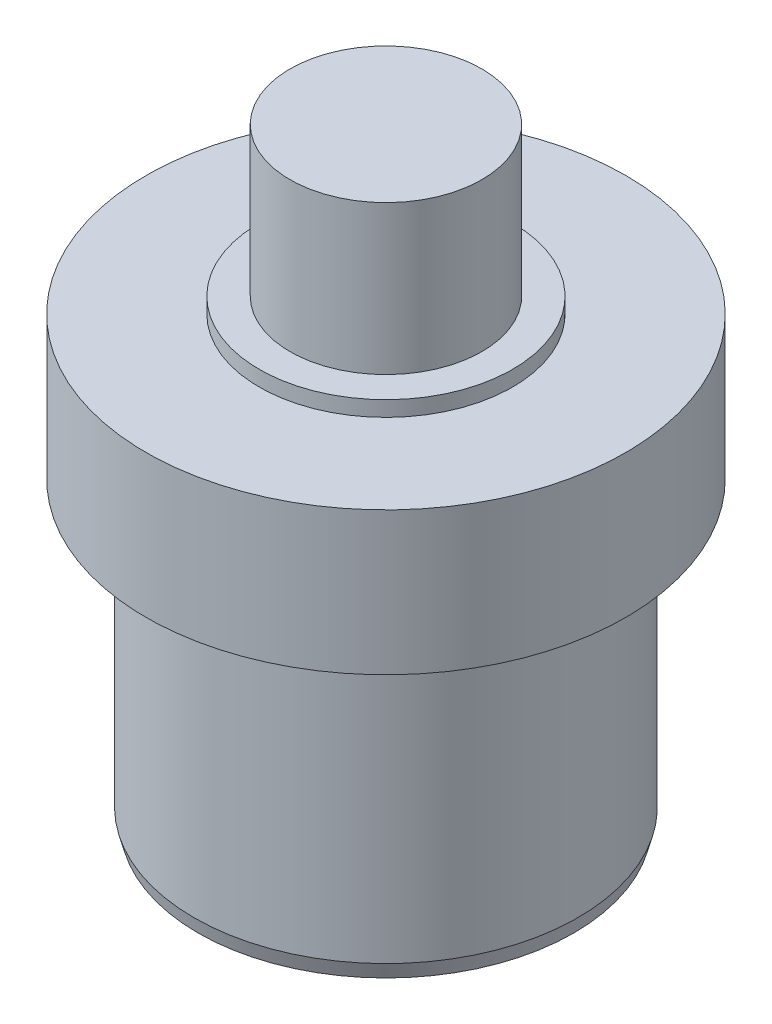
ISO-10303-21;
HEADER;
FILE_DESCRIPTION(('STEP AP214'),'2;1');
FILE_NAME('part.step','',(''),(''),'','','');
FILE_SCHEMA(('AUTOMOTIVE_DESIGN { 1 0 10303 214 1 1 1 1 }'));
ENDSEC;
DATA;
#1=APPLICATION_CONTEXT('core data for automotive mechanical design processes');
#2=APPLICATION_PROTOCOL_DEFINITION('international standard','automotive_design',2000,#1);
#3=PRODUCT_CONTEXT('',#1,'mechanical');
#4=PRODUCT('Part','Part','',(#3));
#5=PRODUCT_RELATED_PRODUCT_CATEGORY('part','',(#4));
#6=PRODUCT_DEFINITION_FORMATION('','',#4);
#7=PRODUCT_DEFINITION_CONTEXT('part definition',#1,'design');
#8=PRODUCT_DEFINITION('design','',#6,#7);
#9=PRODUCT_DEFINITION_SHAPE('','',#8);
#10=(LENGTH_UNIT() NAMED_UNIT(*) SI_UNIT(.MILLI.,.METRE.));
#11=(NAMED_UNIT(*) PLANE_ANGLE_UNIT() SI_UNIT($,.RADIAN.));
#12=(NAMED_UNIT(*) SI_UNIT($,.STERADIAN.) SOLID_ANGLE_UNIT());
#13=UNCERTAINTY_MEASURE_WITH_UNIT(LENGTH_MEASURE(1.E-05),#10,'distance_accuracy_value','');
#14=(GEOMETRIC_REPRESENTATION_CONTEXT(3) GLOBAL_UNCERTAINTY_ASSIGNED_CONTEXT((#13)) GLOBAL_UNIT_ASSIGNED_CONTEXT((#10,
#11,#12)) REPRESENTATION_CONTEXT('',''));
#15=CARTESIAN_POINT('',(0.,0.,0.));
#16=DIRECTION('',(0.,0.,1.));
#17=DIRECTION('',(1.,0.,0.));
#18=AXIS2_PLACEMENT_3D('',#15,#16,#17);
#19=CARTESIAN_POINT('',(0.,2.61620000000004,0.));
#20=DIRECTION('',(0.,0.999999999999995,0.));
#21=DIRECTION('',(0.,0.,0.999999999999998));
#22=AXIS2_PLACEMENT_3D('',#19,#20,#21);
#23=PLANE('',#22);
#24=CARTESIAN_POINT('',(0.,2.61620000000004,0.));
#25=DIRECTION('',(0.,0.999999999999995,0.));
#26=DIRECTION('',(0.,0.,0.999999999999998));
#27=AXIS2_PLACEMENT_3D('',#24,#25,#26);
#28=CIRCLE('',#27,2.0955);
#29=CARTESIAN_POINT('',(0.,2.61620000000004,-2.09549999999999));
#30=VERTEX_POINT('',#29);
#31=EDGE_CURVE('E55',#30,#30,#28,.T.);
#32=ORIENTED_EDGE('',*,*,#31,.T.);
#33=EDGE_LOOP('',(#32));
#34=FACE_BOUND('',#33,.T.);
#35=CARTESIAN_POINT('',(0.,2.61620000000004,0.));
#36=DIRECTION('',(0.,0.999999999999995,0.));
#37=DIRECTION('',(0.,0.,0.999999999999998));
#38=AXIS2_PLACEMENT_3D('',#35,#36,#37);
#39=CIRCLE('',#38,1.5875);
#40=CARTESIAN_POINT('',(0.,2.61620000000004,-1.58749999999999));
#41=VERTEX_POINT('',#40);
#42=EDGE_CURVE('E64',#41,#41,#39,.T.);
#43=ORIENTED_EDGE('',*,*,#42,.F.);
#44=EDGE_LOOP('',(#43));
#45=FACE_BOUND('',#44,.T.);
#46=ADVANCED_FACE('F32',(#34,#45),#23,.T.);
#47=CARTESIAN_POINT('',(0.,2.36220000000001,0.));
#48=DIRECTION('',(0.,0.999999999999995,0.));
#49=DIRECTION('',(0.,0.,0.999999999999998));
#50=AXIS2_PLACEMENT_3D('',#47,#48,#49);
#51=PLANE('',#50);
#52=CARTESIAN_POINT('',(0.,2.36220000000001,0.));
#53=DIRECTION('',(0.,0.999999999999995,0.));
#54=DIRECTION('',(0.,0.,0.999999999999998));
#55=AXIS2_PLACEMENT_3D('',#52,#53,#54);
#56=CIRCLE('',#55,3.96875);
#57=CARTESIAN_POINT('',(0.,2.36220000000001,-3.96875000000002));
#58=VERTEX_POINT('',#57);
#59=EDGE_CURVE('E47',#58,#58,#56,.T.);
#60=ORIENTED_EDGE('',*,*,#59,.T.);
#61=EDGE_LOOP('',(#60));
#62=FACE_BOUND('',#61,.T.);
#63=CARTESIAN_POINT('',(0.,2.36220000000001,0.));
#64=DIRECTION('',(0.,0.999999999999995,0.));
#65=DIRECTION('',(0.,0.,0.999999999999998));
#66=AXIS2_PLACEMENT_3D('',#63,#64,#65);
#67=CIRCLE('',#66,2.0955);
#68=CARTESIAN_POINT('',(0.,2.36220000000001,-2.09549999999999));
#69=VERTEX_POINT('',#68);
#70=EDGE_CURVE('E58',#69,#69,#67,.T.);
#71=ORIENTED_EDGE('',*,*,#70,.F.);
#72=EDGE_LOOP('',(#71));
#73=FACE_BOUND('',#72,.T.);
#74=ADVANCED_FACE('F71',(#62,#73),#51,.T.);
#75=CARTESIAN_POINT('',(0.,0.,0.));
#76=DIRECTION('',(0.,0.999999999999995,0.));
#77=DIRECTION('',(0.,0.,0.999999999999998));
#78=AXIS2_PLACEMENT_3D('',#75,#76,#77);
#79=PLANE('',#78);
#80=CARTESIAN_POINT('',(0.,0.,0.));
#81=DIRECTION('',(0.,0.999999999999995,0.));
#82=DIRECTION('',(0.,0.,0.999999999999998));
#83=AXIS2_PLACEMENT_3D('',#80,#81,#82);
#84=CIRCLE('',#83,3.96875);
#85=CARTESIAN_POINT('',(0.,0.,-3.96875000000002));
#86=VERTEX_POINT('',#85);
#87=EDGE_CURVE('E52',#86,#86,#84,.T.);
#88=ORIENTED_EDGE('',*,*,#87,.F.);
#89=EDGE_LOOP('',(#88));
#90=FACE_BOUND('',#89,.T.);
#91=CARTESIAN_POINT('',(0.,0.,0.));
#92=DIRECTION('',(0.,0.999999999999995,0.));
#93=DIRECTION('',(0.,0.,0.999999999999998));
#94=AXIS2_PLACEMENT_3D('',#91,#92,#93);
#95=CIRCLE('',#94,3.175);
#96=CARTESIAN_POINT('',(0.,0.,3.17499999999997));
#97=VERTEX_POINT('',#96);
#98=EDGE_CURVE('E43',#97,#97,#95,.F.);
#99=ORIENTED_EDGE('',*,*,#98,.F.);
#100=EDGE_LOOP('',(#99));
#101=FACE_BOUND('',#100,.T.);
#102=ADVANCED_FACE('F77',(#90,#101),#79,.F.);
#103=CARTESIAN_POINT('',(0.,2.36220000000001,0.));
#104=DIRECTION('',(0.,-0.999999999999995,0.));
#105=DIRECTION('',(0.,0.,-0.999999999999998));
#106=AXIS2_PLACEMENT_3D('',#103,#104,#105);
#107=CYLINDRICAL_SURFACE('',#106,3.96875);
#108=CARTESIAN_POINT('',(0.,2.36220000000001,-3.96875000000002));
#109=CARTESIAN_POINT('',(0.,2.33759375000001,-3.96875000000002));
#110=CARTESIAN_POINT('',(0.,2.31298750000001,-3.96875000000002));
#111=CARTESIAN_POINT('',(0.,2.26377500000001,-3.96875000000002));
#112=CARTESIAN_POINT('',(0.,2.23916875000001,-3.96875000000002));
#113=CARTESIAN_POINT('',(0.,2.18995625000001,-3.96875000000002));
#114=CARTESIAN_POINT('',(0.,2.16535000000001,-3.96875000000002));
#115=CARTESIAN_POINT('',(0.,2.11613750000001,-3.96875000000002));
#116=CARTESIAN_POINT('',(0.,2.09153125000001,-3.96875000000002));
#117=CARTESIAN_POINT('',(0.,2.04231875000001,-3.96875000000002));
#118=CARTESIAN_POINT('',(0.,2.01771250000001,-3.96875000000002));
#119=CARTESIAN_POINT('',(0.,1.96850000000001,-3.96875000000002));
#120=CARTESIAN_POINT('',(0.,1.94389375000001,-3.96875000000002));
#121=CARTESIAN_POINT('',(0.,1.89468125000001,-3.96875000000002));
#122=CARTESIAN_POINT('',(0.,1.87007500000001,-3.96875000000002));
#123=CARTESIAN_POINT('',(0.,1.82086250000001,-3.96875000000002));
#124=CARTESIAN_POINT('',(0.,1.79625625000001,-3.96875000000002));
#125=CARTESIAN_POINT('',(0.,1.74704375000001,-3.96875000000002));
#126=CARTESIAN_POINT('',(0.,1.72243750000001,-3.96875000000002));
#127=CARTESIAN_POINT('',(0.,1.67322500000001,-3.96875000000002));
#128=CARTESIAN_POINT('',(0.,1.64861875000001,-3.96875000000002));
#129=CARTESIAN_POINT('',(0.,1.59940625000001,-3.96875000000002));
#130=CARTESIAN_POINT('',(0.,1.57480000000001,-3.96875000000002));
#131=CARTESIAN_POINT('',(0.,1.52558750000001,-3.96875000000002));
#132=CARTESIAN_POINT('',(0.,1.50098125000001,-3.96875000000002));
#133=CARTESIAN_POINT('',(0.,1.45176875,-3.96875000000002));
#134=CARTESIAN_POINT('',(0.,1.4271625,-3.96875000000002));
#135=CARTESIAN_POINT('',(0.,1.37795,-3.96875000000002));
#136=CARTESIAN_POINT('',(0.,1.35334375,-3.96875000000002));
#137=CARTESIAN_POINT('',(0.,1.30413125,-3.96875000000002));
#138=CARTESIAN_POINT('',(0.,1.279525,-3.96875000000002));
#139=CARTESIAN_POINT('',(0.,1.2303125,-3.96875000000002));
#140=CARTESIAN_POINT('',(0.,1.20570625,-3.96875000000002));
#141=CARTESIAN_POINT('',(0.,1.15649375,-3.96875000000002));
#142=CARTESIAN_POINT('',(0.,1.1318875,-3.96875000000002));
#143=CARTESIAN_POINT('',(0.,1.082675,-3.96875000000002));
#144=CARTESIAN_POINT('',(0.,1.05806875,-3.96875000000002));
#145=CARTESIAN_POINT('',(0.,1.00885625,-3.96875000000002));
#146=CARTESIAN_POINT('',(0.,0.984250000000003,-3.96875000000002));
#147=CARTESIAN_POINT('',(0.,0.935037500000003,-3.96875000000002));
#148=CARTESIAN_POINT('',(0.,0.910431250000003,-3.96875000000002));
#149=CARTESIAN_POINT('',(0.,0.861218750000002,-3.96875000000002));
#150=CARTESIAN_POINT('',(0.,0.836612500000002,-3.96875000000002));
#151=CARTESIAN_POINT('',(0.,0.787400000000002,-3.96875000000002));
#152=CARTESIAN_POINT('',(0.,0.762793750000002,-3.96875000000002));
#153=CARTESIAN_POINT('',(0.,0.713581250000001,-3.96875000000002));
#154=CARTESIAN_POINT('',(0.,0.688975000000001,-3.96875000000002));
#155=CARTESIAN_POINT('',(0.,0.639762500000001,-3.96875000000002));
#156=CARTESIAN_POINT('',(0.,0.615156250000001,-3.96875000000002));
#157=CARTESIAN_POINT('',(0.,0.565943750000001,-3.96875000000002));
#158=CARTESIAN_POINT('',(0.,0.541337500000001,-3.96875000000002));
#159=CARTESIAN_POINT('',(0.,0.492125,-3.96875000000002));
#160=CARTESIAN_POINT('',(0.,0.46751875,-3.96875000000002));
#161=CARTESIAN_POINT('',(0.,0.41830625,-3.96875000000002));
#162=CARTESIAN_POINT('',(0.,0.3937,-3.96875000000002));
#163=CARTESIAN_POINT('',(0.,0.3444875,-3.96875000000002));
#164=CARTESIAN_POINT('',(0.,0.31988125,-3.96875000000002));
#165=CARTESIAN_POINT('',(0.,0.27066875,-3.96875000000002));
#166=CARTESIAN_POINT('',(0.,0.2460625,-3.96875000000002));
#167=CARTESIAN_POINT('',(0.,0.196849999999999,-3.96875000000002));
#168=CARTESIAN_POINT('',(0.,0.172243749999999,-3.96875000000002));
#169=CARTESIAN_POINT('',(0.,0.123031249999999,-3.96875000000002));
#170=CARTESIAN_POINT('',(0.,0.0984249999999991,-3.96875000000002));
#171=CARTESIAN_POINT('',(0.,0.0492124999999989,-3.96875000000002));
#172=CARTESIAN_POINT('',(0.,0.0246062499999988,-3.96875000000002));
#173=CARTESIAN_POINT('',(0.,0.,-3.96875000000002));
#174=B_SPLINE_CURVE_WITH_KNOTS('',3,(#108,#109,#110,#111,#112,#113,#114,#115,#116,#117,#118,
#119,#120,#121,#122,#123,#124,#125,#126,#127,#128,#129,#130,#131,#132,#133,#134,#135,#136,#137,
#138,#139,#140,#141,#142,#143,#144,#145,#146,#147,#148,#149,#150,#151,#152,#153,#154,#155,#156,
#157,#158,#159,#160,#161,#162,#163,#164,#165,#166,#167,#168,#169,#170,#171,#172,#173),
.UNSPECIFIED.,.F.,.F.,(4,2,2,2,2,2,2,2,2,2,2,2,2,2,2,2,2,2,2,2,2,2,2,2,2,2,2,2,2,2,2,2,4),(0.,
0.0738187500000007,0.147637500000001,0.221456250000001,0.295275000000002,0.369093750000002,
0.442912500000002,0.516731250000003,0.590550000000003,0.664368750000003,0.738187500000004,
0.812006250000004,0.885825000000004,0.959643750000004,1.0334625,1.10728125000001,
1.18110000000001,1.25491875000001,1.32873750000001,1.40255625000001,1.47637500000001,
1.55019375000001,1.62401250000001,1.69783125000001,1.77165000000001,1.84546875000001,
1.91928750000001,1.99310625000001,2.06692500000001,2.14074375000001,2.21456250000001,
2.28838125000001,2.36220000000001),.UNSPECIFIED.);
#175=EDGE_CURVE('BSEAM34',#58,#86,#174,.T.);
#176=ORIENTED_EDGE('',*,*,#59,.F.);
#177=ORIENTED_EDGE('',*,*,#87,.T.);
#178=ORIENTED_EDGE('',*,*,#175,.T.);
#179=ORIENTED_EDGE('',*,*,#175,.F.);
#180=EDGE_LOOP('',(#176,#178,#177,#179));
#181=FACE_BOUND('',#180,.T.);
#182=ADVANCED_FACE('F34',(#181),#107,.T.);
#183=CARTESIAN_POINT('',(0.,-4.95299999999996,0.));
#184=DIRECTION('',(0.,0.999999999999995,0.));
#185=DIRECTION('',(0.,0.,0.999999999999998));
#186=AXIS2_PLACEMENT_3D('',#183,#184,#185);
#187=CYLINDRICAL_SURFACE('',#186,3.175);
#188=CARTESIAN_POINT('',(-1.11022302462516E-13,-4.69899999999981,0.));
#189=DIRECTION('',(0.,-0.999999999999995,0.));
#190=DIRECTION('',(0.,0.,-0.999999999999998));
#191=AXIS2_PLACEMENT_3D('',#188,#189,#190);
#192=CIRCLE('',#191,3.175);
#193=CARTESIAN_POINT('',(0.,-4.69899999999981,3.17499999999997));
#194=VERTEX_POINT('',#193);
#195=EDGE_CURVE('E10',#194,#194,#192,.F.);
#196=CARTESIAN_POINT('',(0.,-4.69899999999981,3.17499999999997));
#197=CARTESIAN_POINT('',(0.,-4.65005208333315,3.17499999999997));
#198=CARTESIAN_POINT('',(0.,-4.60110416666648,3.17499999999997));
#199=CARTESIAN_POINT('',(0.,-4.50320833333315,3.17499999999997));
#200=CARTESIAN_POINT('',(0.,-4.45426041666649,3.17499999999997));
#201=CARTESIAN_POINT('',(0.,-4.35636458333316,3.17499999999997));
#202=CARTESIAN_POINT('',(0.,-4.3074166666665,3.17499999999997));
#203=CARTESIAN_POINT('',(0.,-4.20952083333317,3.17499999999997));
#204=CARTESIAN_POINT('',(0.,-4.1605729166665,3.17499999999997));
#205=CARTESIAN_POINT('',(0.,-4.06267708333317,3.17499999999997));
#206=CARTESIAN_POINT('',(0.,-4.01372916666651,3.17499999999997));
#207=CARTESIAN_POINT('',(0.,-3.91583333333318,3.17499999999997));
#208=CARTESIAN_POINT('',(0.,-3.86688541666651,3.17499999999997));
#209=CARTESIAN_POINT('',(0.,-3.76898958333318,3.17499999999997));
#210=CARTESIAN_POINT('',(0.,-3.72004166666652,3.17499999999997));
#211=CARTESIAN_POINT('',(0.,-3.62214583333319,3.17499999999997));
#212=CARTESIAN_POINT('',(0.,-3.57319791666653,3.17499999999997));
#213=CARTESIAN_POINT('',(0.,-3.4753020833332,3.17499999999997));
#214=CARTESIAN_POINT('',(0.,-3.42635416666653,3.17499999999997));
#215=CARTESIAN_POINT('',(0.,-3.3284583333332,3.17499999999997));
#216=CARTESIAN_POINT('',(0.,-3.27951041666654,3.17499999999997));
#217=CARTESIAN_POINT('',(0.,-3.18161458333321,3.17499999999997));
#218=CARTESIAN_POINT('',(0.,-3.13266666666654,3.17499999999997));
#219=CARTESIAN_POINT('',(0.,-3.03477083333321,3.17499999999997));
#220=CARTESIAN_POINT('',(0.,-2.98582291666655,3.17499999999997));
#221=CARTESIAN_POINT('',(0.,-2.88792708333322,3.17499999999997));
#222=CARTESIAN_POINT('',(0.,-2.83897916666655,3.17499999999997));
#223=CARTESIAN_POINT('',(0.,-2.74108333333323,3.17499999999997));
#224=CARTESIAN_POINT('',(0.,-2.69213541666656,3.17499999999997));
#225=CARTESIAN_POINT('',(0.,-2.59423958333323,3.17499999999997));
#226=CARTESIAN_POINT('',(0.,-2.54529166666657,3.17499999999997));
#227=CARTESIAN_POINT('',(0.,-2.44739583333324,3.17499999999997));
#228=CARTESIAN_POINT('',(0.,-2.39844791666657,3.17499999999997));
#229=CARTESIAN_POINT('',(0.,-2.30055208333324,3.17499999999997));
#230=CARTESIAN_POINT('',(0.,-2.25160416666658,3.17499999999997));
#231=CARTESIAN_POINT('',(0.,-2.15370833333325,3.17499999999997));
#232=CARTESIAN_POINT('',(0.,-2.10476041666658,3.17499999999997));
#233=CARTESIAN_POINT('',(0.,-2.00686458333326,3.17499999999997));
#234=CARTESIAN_POINT('',(0.,-1.95791666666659,3.17499999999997));
#235=CARTESIAN_POINT('',(0.,-1.86002083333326,3.17499999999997));
#236=CARTESIAN_POINT('',(0.,-1.8110729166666,3.17499999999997));
#237=CARTESIAN_POINT('',(0.,-1.71317708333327,3.17499999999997));
#238=CARTESIAN_POINT('',(0.,-1.6642291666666,3.17499999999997));
#239=CARTESIAN_POINT('',(0.,-1.56633333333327,3.17499999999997));
#240=CARTESIAN_POINT('',(0.,-1.51738541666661,3.17499999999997));
#241=CARTESIAN_POINT('',(0.,-1.41948958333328,3.17499999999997));
#242=CARTESIAN_POINT('',(0.,-1.37054166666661,3.17499999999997));
#243=CARTESIAN_POINT('',(0.,-1.27264583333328,3.17499999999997));
#244=CARTESIAN_POINT('',(0.,-1.22369791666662,3.17499999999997));
#245=CARTESIAN_POINT('',(0.,-1.12580208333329,3.17499999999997));
#246=CARTESIAN_POINT('',(0.,-1.07685416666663,3.17499999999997));
#247=CARTESIAN_POINT('',(0.,-0.978958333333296,3.17499999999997));
#248=CARTESIAN_POINT('',(0.,-0.930010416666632,3.17499999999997));
#249=CARTESIAN_POINT('',(0.,-0.832114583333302,3.17499999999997));
#250=CARTESIAN_POINT('',(0.,-0.783166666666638,3.17499999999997));
#251=CARTESIAN_POINT('',(0.,-0.685270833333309,3.17499999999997));
#252=CARTESIAN_POINT('',(0.,-0.636322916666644,3.17499999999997));
#253=CARTESIAN_POINT('',(0.,-0.538427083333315,3.17499999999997));
#254=CARTESIAN_POINT('',(0.,-0.48947916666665,3.17499999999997));
#255=CARTESIAN_POINT('',(0.,-0.39158333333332,3.17499999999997));
#256=CARTESIAN_POINT('',(0.,-0.342635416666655,3.17499999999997));
#257=CARTESIAN_POINT('',(0.,-0.244739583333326,3.17499999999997));
#258=CARTESIAN_POINT('',(0.,-0.195791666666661,3.17499999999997));
#259=CARTESIAN_POINT('',(0.,-0.0978958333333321,3.17499999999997));
#260=CARTESIAN_POINT('',(0.,-0.0489479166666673,3.17499999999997));
#261=CARTESIAN_POINT('',(0.,0.,3.17499999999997));
#262=B_SPLINE_CURVE_WITH_KNOTS('',3,(#196,#197,#198,#199,#200,#201,#202,#203,#204,#205,#206,
#207,#208,#209,#210,#211,#212,#213,#214,#215,#216,#217,#218,#219,#220,#221,#222,#223,#224,#225,
#226,#227,#228,#229,#230,#231,#232,#233,#234,#235,#236,#237,#238,#239,#240,#241,#242,#243,#244,
#245,#246,#247,#248,#249,#250,#251,#252,#253,#254,#255,#256,#257,#258,#259,#260,#261),
.UNSPECIFIED.,.F.,.F.,(4,2,2,2,2,2,2,2,2,2,2,2,2,2,2,2,2,2,2,2,2,2,2,2,2,2,2,2,2,2,2,2,4),(0.,
0.146843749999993,0.293687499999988,0.440531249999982,0.587374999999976,0.73421874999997,
0.881062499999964,1.02790624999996,1.17474999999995,1.32159374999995,1.46843749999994,
1.61528124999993,1.76212499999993,1.90896874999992,2.05581249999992,2.20265624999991,
2.3494999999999,2.4963437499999,2.64318749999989,2.79003124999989,2.93687499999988,
3.08371874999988,3.23056249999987,3.37740624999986,3.52424999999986,3.67109374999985,
3.81793749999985,3.96478124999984,4.11162499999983,4.25846874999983,4.40531249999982,
4.55215624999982,4.69899999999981),.UNSPECIFIED.);
#263=EDGE_CURVE('BSEAM89',#194,#97,#262,.T.);
#264=ORIENTED_EDGE('',*,*,#195,.T.);
#265=ORIENTED_EDGE('',*,*,#98,.T.);
#266=ORIENTED_EDGE('',*,*,#263,.T.);
#267=ORIENTED_EDGE('',*,*,#263,.F.);
#268=EDGE_LOOP('',(#264,#266,#265,#267));
#269=FACE_BOUND('',#268,.T.);
#270=ADVANCED_FACE('F89',(#269),#187,.T.);
#271=CARTESIAN_POINT('',(0.,-4.95299999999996,0.));
#272=DIRECTION('',(0.,-0.999999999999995,0.));
#273=DIRECTION('',(0.,0.,-0.999999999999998));
#274=AXIS2_PLACEMENT_3D('',#271,#272,#273);
#275=PLANE('',#274);
#276=CARTESIAN_POINT('',(0.,-4.95299999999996,0.));
#277=DIRECTION('',(0.,-0.999999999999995,0.));
#278=DIRECTION('',(0.,0.,-0.999999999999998));
#279=AXIS2_PLACEMENT_3D('',#276,#277,#278);
#280=CIRCLE('',#279,3.1069409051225);
#281=CARTESIAN_POINT('',(0.,-4.95299999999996,3.10694090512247));
#282=VERTEX_POINT('',#281);
#283=EDGE_CURVE('E39',#282,#282,#280,.T.);
#284=ORIENTED_EDGE('',*,*,#283,.T.);
#285=EDGE_LOOP('',(#284));
#286=FACE_BOUND('',#285,.T.);
#287=ADVANCED_FACE('F85',(#286),#275,.T.);
#288=CARTESIAN_POINT('',(0.,2.61620000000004,0.));
#289=DIRECTION('',(0.,-0.999999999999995,0.));
#290=DIRECTION('',(0.,0.,-0.999999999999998));
#291=AXIS2_PLACEMENT_3D('',#288,#289,#290);
#292=CYLINDRICAL_SURFACE('',#291,2.0955);
#293=CARTESIAN_POINT('',(0.,2.61620000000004,-2.09549999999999));
#294=CARTESIAN_POINT('',(0.,2.61355416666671,-2.09549999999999));
#295=CARTESIAN_POINT('',(0.,2.61090833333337,-2.09549999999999));
#296=CARTESIAN_POINT('',(0.,2.6056166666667,-2.09549999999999));
#297=CARTESIAN_POINT('',(0.,2.60297083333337,-2.09549999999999));
#298=CARTESIAN_POINT('',(0.,2.5976791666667,-2.09549999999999));
#299=CARTESIAN_POINT('',(0.,2.59503333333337,-2.09549999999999));
#300=CARTESIAN_POINT('',(0.,2.5897416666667,-2.09549999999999));
#301=CARTESIAN_POINT('',(0.,2.58709583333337,-2.09549999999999));
#302=CARTESIAN_POINT('',(0.,2.5818041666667,-2.09549999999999));
#303=CARTESIAN_POINT('',(0.,2.57915833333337,-2.09549999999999));
#304=CARTESIAN_POINT('',(0.,2.5738666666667,-2.09549999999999));
#305=CARTESIAN_POINT('',(0.,2.57122083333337,-2.09549999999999));
#306=CARTESIAN_POINT('',(0.,2.5659291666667,-2.09549999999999));
#307=CARTESIAN_POINT('',(0.,2.56328333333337,-2.09549999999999));
#308=CARTESIAN_POINT('',(0.,2.5579916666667,-2.09549999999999));
#309=CARTESIAN_POINT('',(0.,2.55534583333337,-2.09549999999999));
#310=CARTESIAN_POINT('',(0.,2.5500541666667,-2.09549999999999));
#311=CARTESIAN_POINT('',(0.,2.54740833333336,-2.09549999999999));
#312=CARTESIAN_POINT('',(0.,2.5421166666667,-2.09549999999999));
#313=CARTESIAN_POINT('',(0.,2.53947083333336,-2.09549999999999));
#314=CARTESIAN_POINT('',(0.,2.5341791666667,-2.09549999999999));
#315=CARTESIAN_POINT('',(0.,2.53153333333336,-2.09549999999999));
#316=CARTESIAN_POINT('',(0.,2.5262416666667,-2.09549999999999));
#317=CARTESIAN_POINT('',(0.,2.52359583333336,-2.09549999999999));
#318=CARTESIAN_POINT('',(0.,2.51830416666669,-2.09549999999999));
#319=CARTESIAN_POINT('',(0.,2.51565833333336,-2.09549999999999));
#320=CARTESIAN_POINT('',(0.,2.51036666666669,-2.09549999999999));
#321=CARTESIAN_POINT('',(0.,2.50772083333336,-2.09549999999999));
#322=CARTESIAN_POINT('',(0.,2.50242916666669,-2.09549999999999));
#323=CARTESIAN_POINT('',(0.,2.49978333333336,-2.09549999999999));
#324=CARTESIAN_POINT('',(0.,2.49449166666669,-2.09549999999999));
#325=CARTESIAN_POINT('',(0.,2.49184583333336,-2.09549999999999));
#326=CARTESIAN_POINT('',(0.,2.48655416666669,-2.09549999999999));
#327=CARTESIAN_POINT('',(0.,2.48390833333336,-2.09549999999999));
#328=CARTESIAN_POINT('',(0.,2.47861666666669,-2.09549999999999));
#329=CARTESIAN_POINT('',(0.,2.47597083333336,-2.09549999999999));
#330=CARTESIAN_POINT('',(0.,2.47067916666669,-2.09549999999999));
#331=CARTESIAN_POINT('',(0.,2.46803333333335,-2.09549999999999));
#332=CARTESIAN_POINT('',(0.,2.46274166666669,-2.09549999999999));
#333=CARTESIAN_POINT('',(0.,2.46009583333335,-2.09549999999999));
#334=CARTESIAN_POINT('',(0.,2.45480416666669,-2.09549999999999));
#335=CARTESIAN_POINT('',(0.,2.45215833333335,-2.09549999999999));
#336=CARTESIAN_POINT('',(0.,2.44686666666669,-2.09549999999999));
#337=CARTESIAN_POINT('',(0.,2.44422083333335,-2.09549999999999));
#338=CARTESIAN_POINT('',(0.,2.43892916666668,-2.09549999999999));
#339=CARTESIAN_POINT('',(0.,2.43628333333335,-2.09549999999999));
#340=CARTESIAN_POINT('',(0.,2.43099166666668,-2.09549999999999));
#341=CARTESIAN_POINT('',(0.,2.42834583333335,-2.09549999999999));
#342=CARTESIAN_POINT('',(0.,2.42305416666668,-2.09549999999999));
#343=CARTESIAN_POINT('',(0.,2.42040833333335,-2.09549999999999));
#344=CARTESIAN_POINT('',(0.,2.41511666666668,-2.09549999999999));
#345=CARTESIAN_POINT('',(0.,2.41247083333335,-2.09549999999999));
#346=CARTESIAN_POINT('',(0.,2.40717916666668,-2.09549999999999));
#347=CARTESIAN_POINT('',(0.,2.40453333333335,-2.09549999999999));
#348=CARTESIAN_POINT('',(0.,2.39924166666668,-2.09549999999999));
#349=CARTESIAN_POINT('',(0.,2.39659583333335,-2.09549999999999));
#350=CARTESIAN_POINT('',(0.,2.39130416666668,-2.09549999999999));
#351=CARTESIAN_POINT('',(0.,2.38865833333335,-2.09549999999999));
#352=CARTESIAN_POINT('',(0.,2.38336666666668,-2.09549999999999));
#353=CARTESIAN_POINT('',(0.,2.38072083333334,-2.09549999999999));
#354=CARTESIAN_POINT('',(0.,2.37542916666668,-2.09549999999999));
#355=CARTESIAN_POINT('',(0.,2.37278333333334,-2.09549999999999));
#356=CARTESIAN_POINT('',(0.,2.36749166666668,-2.09549999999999));
#357=CARTESIAN_POINT('',(0.,2.36484583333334,-2.09549999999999));
#358=CARTESIAN_POINT('',(0.,2.36220000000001,-2.09549999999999));
#359=B_SPLINE_CURVE_WITH_KNOTS('',3,(#293,#294,#295,#296,#297,#298,#299,#300,#301,#302,#303,
#304,#305,#306,#307,#308,#309,#310,#311,#312,#313,#314,#315,#316,#317,#318,#319,#320,#321,#322,
#323,#324,#325,#326,#327,#328,#329,#330,#331,#332,#333,#334,#335,#336,#337,#338,#339,#340,#341,
#342,#343,#344,#345,#346,#347,#348,#349,#350,#351,#352,#353,#354,#355,#356,#357,#358),
.UNSPECIFIED.,.F.,.F.,(4,2,2,2,2,2,2,2,2,2,2,2,2,2,2,2,2,2,2,2,2,2,2,2,2,2,2,2,2,2,2,2,4),(0.,
0.00793750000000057,0.0158750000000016,0.0238125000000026,0.0317500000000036,0.0396875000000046,
0.0476250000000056,0.0555625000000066,0.0635000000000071,0.0714375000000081,0.0793750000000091,
0.0873125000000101,0.0952500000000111,0.103187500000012,0.111125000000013,0.119062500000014,
0.127000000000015,0.134937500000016,0.142875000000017,0.150812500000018,0.158750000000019,
0.16668750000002,0.174625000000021,0.182562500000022,0.190500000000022,0.198437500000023,
0.206375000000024,0.214312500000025,0.222250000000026,0.230187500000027,0.238125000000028,
0.246062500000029,0.25400000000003),.UNSPECIFIED.);
#360=EDGE_CURVE('BSEAM82',#30,#69,#359,.T.);
#361=ORIENTED_EDGE('',*,*,#31,.F.);
#362=ORIENTED_EDGE('',*,*,#70,.T.);
#363=ORIENTED_EDGE('',*,*,#360,.T.);
#364=ORIENTED_EDGE('',*,*,#360,.F.);
#365=EDGE_LOOP('',(#361,#363,#362,#364));
#366=FACE_BOUND('',#365,.T.);
#367=ADVANCED_FACE('F82',(#366),#292,.T.);
#368=CARTESIAN_POINT('',(0.,5.0800000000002,0.));
#369=DIRECTION('',(0.,-0.999999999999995,0.));
#370=DIRECTION('',(0.,0.,-0.999999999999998));
#371=AXIS2_PLACEMENT_3D('',#368,#369,#370);
#372=CYLINDRICAL_SURFACE('',#371,1.5875);
#373=CARTESIAN_POINT('',(0.,5.0800000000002,0.));
#374=DIRECTION('',(0.,0.999999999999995,0.));
#375=DIRECTION('',(0.,0.,0.999999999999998));
#376=AXIS2_PLACEMENT_3D('',#373,#374,#375);
#377=CIRCLE('',#376,1.5875);
#378=CARTESIAN_POINT('',(0.,5.0800000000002,-1.58749999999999));
#379=VERTEX_POINT('',#378);
#380=EDGE_CURVE('E61',#379,#379,#377,.T.);
#381=CARTESIAN_POINT('',(0.,5.0800000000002,-1.58749999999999));
#382=CARTESIAN_POINT('',(0.,5.05433541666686,-1.58749999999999));
#383=CARTESIAN_POINT('',(0.,5.02867083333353,-1.58749999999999));
#384=CARTESIAN_POINT('',(0.,4.97734166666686,-1.58749999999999));
#385=CARTESIAN_POINT('',(0.,4.95167708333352,-1.58749999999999));
#386=CARTESIAN_POINT('',(0.,4.90034791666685,-1.58749999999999));
#387=CARTESIAN_POINT('',(0.,4.87468333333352,-1.58749999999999));
#388=CARTESIAN_POINT('',(0.,4.82335416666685,-1.58749999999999));
#389=CARTESIAN_POINT('',(0.,4.79768958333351,-1.58749999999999));
#390=CARTESIAN_POINT('',(0.,4.74636041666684,-1.58749999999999));
#391=CARTESIAN_POINT('',(0.,4.72069583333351,-1.58749999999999));
#392=CARTESIAN_POINT('',(0.,4.66936666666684,-1.58749999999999));
#393=CARTESIAN_POINT('',(0.,4.6437020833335,-1.58749999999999));
#394=CARTESIAN_POINT('',(0.,4.59237291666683,-1.58749999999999));
#395=CARTESIAN_POINT('',(0.,4.5667083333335,-1.58749999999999));
#396=CARTESIAN_POINT('',(0.,4.51537916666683,-1.58749999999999));
#397=CARTESIAN_POINT('',(0.,4.48971458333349,-1.58749999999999));
#398=CARTESIAN_POINT('',(0.,4.43838541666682,-1.58749999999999));
#399=CARTESIAN_POINT('',(0.,4.41272083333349,-1.58749999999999));
#400=CARTESIAN_POINT('',(0.,4.36139166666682,-1.58749999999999));
#401=CARTESIAN_POINT('',(0.,4.33572708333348,-1.58749999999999));
#402=CARTESIAN_POINT('',(0.,4.28439791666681,-1.58749999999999));
#403=CARTESIAN_POINT('',(0.,4.25873333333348,-1.58749999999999));
#404=CARTESIAN_POINT('',(0.,4.20740416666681,-1.58749999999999));
#405=CARTESIAN_POINT('',(0.,4.18173958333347,-1.58749999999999));
#406=CARTESIAN_POINT('',(0.,4.1304104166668,-1.58749999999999));
#407=CARTESIAN_POINT('',(0.,4.10474583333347,-1.58749999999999));
#408=CARTESIAN_POINT('',(0.,4.0534166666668,-1.58749999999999));
#409=CARTESIAN_POINT('',(0.,4.02775208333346,-1.58749999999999));
#410=CARTESIAN_POINT('',(0.,3.97642291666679,-1.58749999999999));
#411=CARTESIAN_POINT('',(0.,3.95075833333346,-1.58749999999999));
#412=CARTESIAN_POINT('',(0.,3.89942916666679,-1.58749999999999));
#413=CARTESIAN_POINT('',(0.,3.87376458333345,-1.58749999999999));
#414=CARTESIAN_POINT('',(0.,3.82243541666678,-1.58749999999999));
#415=CARTESIAN_POINT('',(0.,3.79677083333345,-1.58749999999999));
#416=CARTESIAN_POINT('',(0.,3.74544166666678,-1.58749999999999));
#417=CARTESIAN_POINT('',(0.,3.71977708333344,-1.58749999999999));
#418=CARTESIAN_POINT('',(0.,3.66844791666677,-1.58749999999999));
#419=CARTESIAN_POINT('',(0.,3.64278333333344,-1.58749999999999));
#420=CARTESIAN_POINT('',(0.,3.59145416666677,-1.58749999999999));
#421=CARTESIAN_POINT('',(0.,3.56578958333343,-1.58749999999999));
#422=CARTESIAN_POINT('',(0.,3.51446041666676,-1.58749999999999));
#423=CARTESIAN_POINT('',(0.,3.48879583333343,-1.58749999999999));
#424=CARTESIAN_POINT('',(0.,3.43746666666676,-1.58749999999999));
#425=CARTESIAN_POINT('',(0.,3.41180208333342,-1.58749999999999));
#426=CARTESIAN_POINT('',(0.,3.36047291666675,-1.58749999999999));
#427=CARTESIAN_POINT('',(0.,3.33480833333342,-1.58749999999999));
#428=CARTESIAN_POINT('',(0.,3.28347916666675,-1.58749999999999));
#429=CARTESIAN_POINT('',(0.,3.25781458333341,-1.58749999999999));
#430=CARTESIAN_POINT('',(0.,3.20648541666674,-1.58749999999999));
#431=CARTESIAN_POINT('',(0.,3.18082083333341,-1.58749999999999));
#432=CARTESIAN_POINT('',(0.,3.12949166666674,-1.58749999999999));
#433=CARTESIAN_POINT('',(0.,3.1038270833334,-1.58749999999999));
#434=CARTESIAN_POINT('',(0.,3.05249791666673,-1.58749999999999));
#435=CARTESIAN_POINT('',(0.,3.0268333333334,-1.58749999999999));
#436=CARTESIAN_POINT('',(0.,2.97550416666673,-1.58749999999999));
#437=CARTESIAN_POINT('',(0.,2.94983958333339,-1.58749999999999));
#438=CARTESIAN_POINT('',(0.,2.89851041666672,-1.58749999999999));
#439=CARTESIAN_POINT('',(0.,2.87284583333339,-1.58749999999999));
#440=CARTESIAN_POINT('',(0.,2.82151666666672,-1.58749999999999));
#441=CARTESIAN_POINT('',(0.,2.79585208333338,-1.58749999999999));
#442=CARTESIAN_POINT('',(0.,2.74452291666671,-1.58749999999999));
#443=CARTESIAN_POINT('',(0.,2.71885833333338,-1.58749999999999));
#444=CARTESIAN_POINT('',(0.,2.66752916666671,-1.58749999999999));
#445=CARTESIAN_POINT('',(0.,2.64186458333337,-1.58749999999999));
#446=CARTESIAN_POINT('',(0.,2.61620000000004,-1.58749999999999));
#447=B_SPLINE_CURVE_WITH_KNOTS('',3,(#381,#382,#383,#384,#385,#386,#387,#388,#389,#390,#391,
#392,#393,#394,#395,#396,#397,#398,#399,#400,#401,#402,#403,#404,#405,#406,#407,#408,#409,#410,
#411,#412,#413,#414,#415,#416,#417,#418,#419,#420,#421,#422,#423,#424,#425,#426,#427,#428,#429,
#430,#431,#432,#433,#434,#435,#436,#437,#438,#439,#440,#441,#442,#443,#444,#445,#446),
.UNSPECIFIED.,.F.,.F.,(4,2,2,2,2,2,2,2,2,2,2,2,2,2,2,2,2,2,2,2,2,2,2,2,2,2,2,2,2,2,2,2,4),(0.,
0.0769937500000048,0.15398750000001,0.230981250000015,0.307975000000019,0.384968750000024,
0.461962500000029,0.538956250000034,0.615950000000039,0.692943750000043,0.769937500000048,
0.846931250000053,0.923925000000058,1.00091875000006,1.07791250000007,1.15490625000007,
1.23190000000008,1.30889375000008,1.38588750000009,1.46288125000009,1.5398750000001,
1.6168687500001,1.69386250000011,1.77085625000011,1.84785000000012,1.92484375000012,
2.00183750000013,2.07883125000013,2.15582500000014,2.23281875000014,2.30981250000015,
2.38680625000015,2.46380000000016),.UNSPECIFIED.);
#448=EDGE_CURVE('BSEAM68',#379,#41,#447,.T.);
#449=ORIENTED_EDGE('',*,*,#380,.F.);
#450=ORIENTED_EDGE('',*,*,#42,.T.);
#451=ORIENTED_EDGE('',*,*,#448,.T.);
#452=ORIENTED_EDGE('',*,*,#448,.F.);
#453=EDGE_LOOP('',(#449,#451,#450,#452));
#454=FACE_BOUND('',#453,.T.);
#455=ADVANCED_FACE('F68',(#454),#372,.T.);
#456=CARTESIAN_POINT('',(0.,5.0800000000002,0.));
#457=DIRECTION('',(0.,0.999999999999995,0.));
#458=DIRECTION('',(0.,0.,0.999999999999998));
#459=AXIS2_PLACEMENT_3D('',#456,#457,#458);
#460=PLANE('',#459);
#461=ORIENTED_EDGE('',*,*,#380,.T.);
#462=EDGE_LOOP('',(#461));
#463=FACE_BOUND('',#462,.T.);
#464=ADVANCED_FACE('F128',(#463),#460,.T.);
#465=CARTESIAN_POINT('',(0.,-4.95299999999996,0.));
#466=DIRECTION('',(0.,0.999999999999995,0.));
#467=DIRECTION('',(0.,0.,0.999999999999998));
#468=AXIS2_PLACEMENT_3D('',#465,#466,#467);
#469=CONICAL_SURFACE('',#468,3.1069409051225,0.261799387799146);
#470=CARTESIAN_POINT('',(0.,-4.69899999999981,3.17500000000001));
#471=CARTESIAN_POINT('',(0.,-4.70164583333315,3.17429105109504));
#472=CARTESIAN_POINT('',(0.,-4.70429166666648,3.17358210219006));
#473=CARTESIAN_POINT('',(0.,-4.70958333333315,3.17216420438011));
#474=CARTESIAN_POINT('',(0.,-4.71222916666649,3.17145525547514));
#475=CARTESIAN_POINT('',(0.,-4.71752083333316,3.17003735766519));
#476=CARTESIAN_POINT('',(0.,-4.72016666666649,3.16932840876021));
#477=CARTESIAN_POINT('',(0.,-4.72545833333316,3.16791051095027));
#478=CARTESIAN_POINT('',(0.,-4.7281041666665,3.16720156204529));
#479=CARTESIAN_POINT('',(0.,-4.73339583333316,3.16578366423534));
#480=CARTESIAN_POINT('',(0.,-4.7360416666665,3.16507471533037));
#481=CARTESIAN_POINT('',(0.,-4.74133333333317,3.16365681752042));
#482=CARTESIAN_POINT('',(0.,-4.7439791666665,3.16294786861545));
#483=CARTESIAN_POINT('',(0.,-4.74927083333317,3.1615299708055));
#484=CARTESIAN_POINT('',(0.,-4.75191666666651,3.16082102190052));
#485=CARTESIAN_POINT('',(0.,-4.75720833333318,3.15940312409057));
#486=CARTESIAN_POINT('',(0.,-4.75985416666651,3.1586941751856));
#487=CARTESIAN_POINT('',(0.,-4.76514583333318,3.15727627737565));
#488=CARTESIAN_POINT('',(0.,-4.76779166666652,3.15656732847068));
#489=CARTESIAN_POINT('',(0.,-4.77308333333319,3.15514943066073));
#490=CARTESIAN_POINT('',(0.,-4.77572916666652,3.15444048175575));
#491=CARTESIAN_POINT('',(0.,-4.78102083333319,3.1530225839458));
#492=CARTESIAN_POINT('',(0.,-4.78366666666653,3.15231363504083));
#493=CARTESIAN_POINT('',(0.,-4.7889583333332,3.15089573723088));
#494=CARTESIAN_POINT('',(0.,-4.79160416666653,3.15018678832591));
#495=CARTESIAN_POINT('',(0.,-4.7968958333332,3.14876889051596));
#496=CARTESIAN_POINT('',(0.,-4.79954166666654,3.14805994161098));
#497=CARTESIAN_POINT('',(0.,-4.8048333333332,3.14664204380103));
#498=CARTESIAN_POINT('',(0.,-4.80747916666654,3.14593309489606));
#499=CARTESIAN_POINT('',(0.,-4.81277083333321,3.14451519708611));
#500=CARTESIAN_POINT('',(0.,-4.81541666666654,3.14380624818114));
#501=CARTESIAN_POINT('',(0.,-4.82070833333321,3.14238835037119));
#502=CARTESIAN_POINT('',(0.,-4.82335416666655,3.14167940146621));
#503=CARTESIAN_POINT('',(0.,-4.82864583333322,3.14026150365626));
#504=CARTESIAN_POINT('',(0.,-4.83129166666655,3.13955255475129));
#505=CARTESIAN_POINT('',(0.,-4.83658333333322,3.13813465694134));
#506=CARTESIAN_POINT('',(0.,-4.83922916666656,3.13742570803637));
#507=CARTESIAN_POINT('',(0.,-4.84452083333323,3.13600781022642));
#508=CARTESIAN_POINT('',(0.,-4.84716666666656,3.13529886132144));
#509=CARTESIAN_POINT('',(0.,-4.85245833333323,3.13388096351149));
#510=CARTESIAN_POINT('',(0.,-4.85510416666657,3.13317201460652));
#511=CARTESIAN_POINT('',(0.,-4.86039583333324,3.13175411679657));
#512=CARTESIAN_POINT('',(0.,-4.86304166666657,3.1310451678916));
#513=CARTESIAN_POINT('',(0.,-4.86833333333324,3.12962727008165));
#514=CARTESIAN_POINT('',(0.,-4.87097916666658,3.12891832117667));
#515=CARTESIAN_POINT('',(0.,-4.87627083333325,3.12750042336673));
#516=CARTESIAN_POINT('',(0.,-4.87891666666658,3.12679147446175));
#517=CARTESIAN_POINT('',(0.,-4.88420833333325,3.1253735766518));
#518=CARTESIAN_POINT('',(0.,-4.88685416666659,3.12466462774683));
#519=CARTESIAN_POINT('',(0.,-4.89214583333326,3.12324672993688));
#520=CARTESIAN_POINT('',(0.,-4.89479166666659,3.1225377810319));
#521=CARTESIAN_POINT('',(0.,-4.90008333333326,3.12111988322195));
#522=CARTESIAN_POINT('',(0.,-4.90272916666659,3.12041093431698));
#523=CARTESIAN_POINT('',(0.,-4.90802083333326,3.11899303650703));
#524=CARTESIAN_POINT('',(0.,-4.9106666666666,3.11828408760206));
#525=CARTESIAN_POINT('',(0.,-4.91595833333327,3.11686618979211));
#526=CARTESIAN_POINT('',(0.,-4.9186041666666,3.11615724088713));
#527=CARTESIAN_POINT('',(0.,-4.92389583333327,3.11473934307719));
#528=CARTESIAN_POINT('',(0.,-4.92654166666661,3.11403039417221));
#529=CARTESIAN_POINT('',(0.,-4.93183333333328,3.11261249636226));
#530=CARTESIAN_POINT('',(0.,-4.93447916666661,3.11190354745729));
#531=CARTESIAN_POINT('',(0.,-4.93977083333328,3.11048564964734));
#532=CARTESIAN_POINT('',(0.,-4.94241666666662,3.10977670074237));
#533=CARTESIAN_POINT('',(0.,-4.94770833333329,3.10835880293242));
#534=CARTESIAN_POINT('',(0.,-4.95035416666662,3.10764985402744));
#535=CARTESIAN_POINT('',(0.,-4.95299999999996,3.10694090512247));
#536=B_SPLINE_CURVE_WITH_KNOTS('',3,(#470,#471,#472,#473,#474,#475,#476,#477,#478,#479,#480,
#481,#482,#483,#484,#485,#486,#487,#488,#489,#490,#491,#492,#493,#494,#495,#496,#497,#498,#499,
#500,#501,#502,#503,#504,#505,#506,#507,#508,#509,#510,#511,#512,#513,#514,#515,#516,#517,#518,
#519,#520,#521,#522,#523,#524,#525,#526,#527,#528,#529,#530,#531,#532,#533,#534,#535),
.UNSPECIFIED.,.F.,.F.,(4,2,2,2,2,2,2,2,2,2,2,2,2,2,2,2,2,2,2,2,2,2,2,2,2,2,2,2,2,2,2,2,4),(0.,
0.00821750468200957,0.0164350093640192,0.0246525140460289,0.0328700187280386,0.0410875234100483,
0.0493050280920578,0.0575225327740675,0.0657400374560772,0.0739575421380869,0.0821750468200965,
0.0903925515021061,0.0986100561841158,0.106827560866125,0.115045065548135,0.123262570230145,
0.131480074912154,0.139697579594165,0.147915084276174,0.156132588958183,0.164350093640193,
0.172567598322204,0.180785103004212,0.189002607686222,0.197220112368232,0.205437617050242,
0.213655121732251,0.221872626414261,0.23009013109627,0.238307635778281,0.24652514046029,
0.254742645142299,0.262960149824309),.UNSPECIFIED.);
#537=EDGE_CURVE('BSEAM135',#194,#282,#536,.T.);
#538=ORIENTED_EDGE('',*,*,#195,.F.);
#539=ORIENTED_EDGE('',*,*,#283,.F.);
#540=ORIENTED_EDGE('',*,*,#537,.T.);
#541=ORIENTED_EDGE('',*,*,#537,.F.);
#542=EDGE_LOOP('',(#538,#540,#539,#541));
#543=FACE_BOUND('',#542,.T.);
#544=ADVANCED_FACE('F135',(#543),#469,.T.);
#545=CLOSED_SHELL('',(#46,#74,#102,#182,#270,#287,#367,#455,#464,#544));
#546=MANIFOLD_SOLID_BREP('B2',#545);
#547=ADVANCED_BREP_SHAPE_REPRESENTATION('',(#18,#546),#14);
#548=SHAPE_DEFINITION_REPRESENTATION(#9,#547);
ENDSEC;
END-ISO-10303-21;
